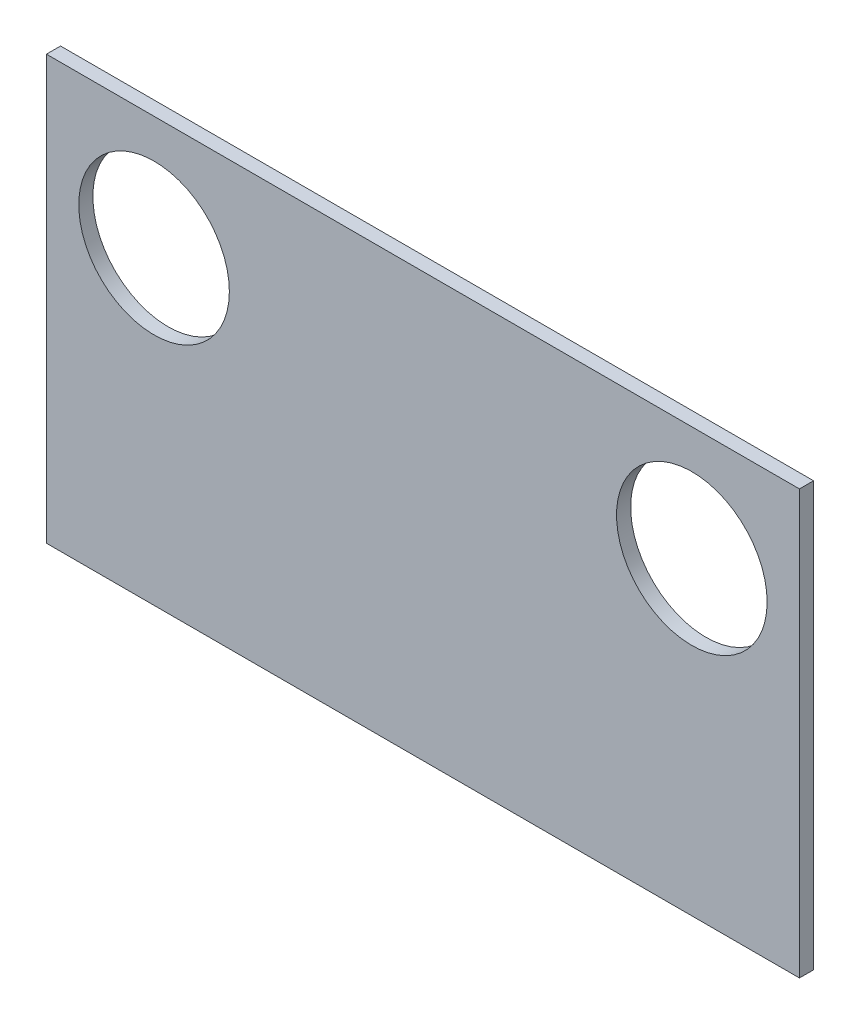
from build123d import *

# Parameters (mm, degrees)
BOSS_EXTRU_1_START = 0.65
ESQUISSE1_W        = 16
ESQUISSE1_H        = 9
ESQUISSE1_R        = 1.6
BOSS_EXTRU_1_DEPTH = 0.3


with BuildPart() as part:
    # Esquisse1 → Boss.-Extru.1 (new body)
    with BuildSketch(Plane.XY.offset(BOSS_EXTRU_1_START)):
        with Locations((0, 16.044994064)):
            Rectangle(ESQUISSE1_W, ESQUISSE1_H)
        with Locations((-5.713410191, 18.120622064)):
            Circle(ESQUISSE1_R, mode=Mode.SUBTRACT)
        with Locations((5.713410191, 18.120622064)):
            Circle(ESQUISSE1_R, mode=Mode.SUBTRACT)
    extrude(amount=BOSS_EXTRU_1_DEPTH)


solid = part.part
